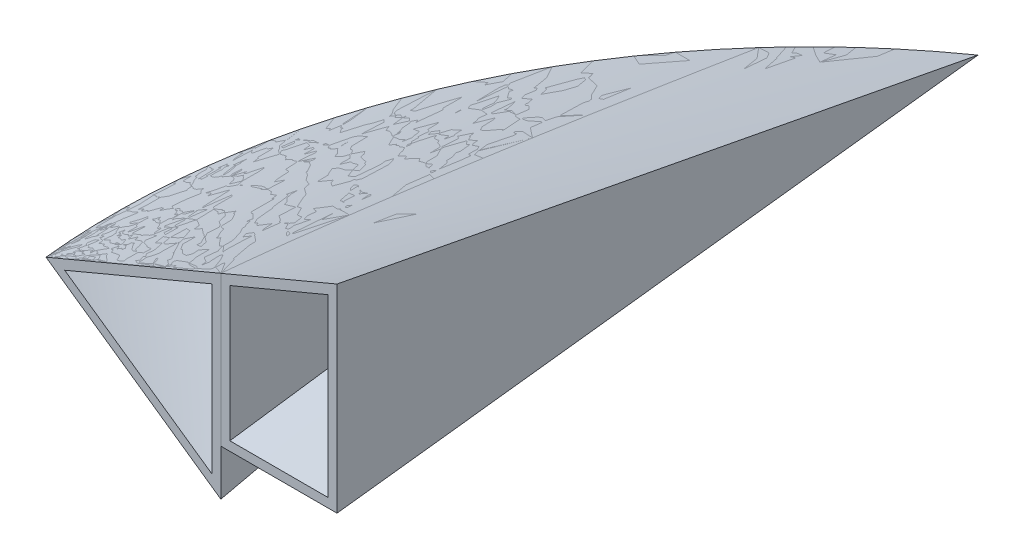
ISO-10303-21;
HEADER;
FILE_DESCRIPTION(('STEP AP214'),'2;1');
FILE_NAME('part.step','',(''),(''),'','','');
FILE_SCHEMA(('AUTOMOTIVE_DESIGN { 1 0 10303 214 1 1 1 1 }'));
ENDSEC;
DATA;
#1=APPLICATION_CONTEXT('core data for automotive mechanical design processes');
#2=APPLICATION_PROTOCOL_DEFINITION('international standard','automotive_design',2000,#1);
#3=PRODUCT_CONTEXT('',#1,'mechanical');
#4=PRODUCT('Part','Part','',(#3));
#5=PRODUCT_RELATED_PRODUCT_CATEGORY('part','',(#4));
#6=PRODUCT_DEFINITION_FORMATION('','',#4);
#7=PRODUCT_DEFINITION_CONTEXT('part definition',#1,'design');
#8=PRODUCT_DEFINITION('design','',#6,#7);
#9=PRODUCT_DEFINITION_SHAPE('','',#8);
#10=(LENGTH_UNIT() NAMED_UNIT(*) SI_UNIT(.MILLI.,.METRE.));
#11=(NAMED_UNIT(*) PLANE_ANGLE_UNIT() SI_UNIT($,.RADIAN.));
#12=(NAMED_UNIT(*) SI_UNIT($,.STERADIAN.) SOLID_ANGLE_UNIT());
#13=UNCERTAINTY_MEASURE_WITH_UNIT(LENGTH_MEASURE(1.E-05),#10,'distance_accuracy_value','');
#14=(GEOMETRIC_REPRESENTATION_CONTEXT(3) GLOBAL_UNCERTAINTY_ASSIGNED_CONTEXT((#13)) GLOBAL_UNIT_ASSIGNED_CONTEXT((#10,
#11,#12)) REPRESENTATION_CONTEXT('',''));
#15=CARTESIAN_POINT('',(0.,0.,0.));
#16=DIRECTION('',(0.,0.,1.));
#17=DIRECTION('',(1.,0.,0.));
#18=AXIS2_PLACEMENT_3D('',#15,#16,#17);
#19=CARTESIAN_POINT('',(-105.774102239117,0.00399017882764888,0.));
#20=DIRECTION('',(0.,0.,-1.));
#21=DIRECTION('',(-1.,0.,0.));
#22=AXIS2_PLACEMENT_3D('',#19,#20,#21);
#23=PLANE('',#22);
#24=DIRECTION('',(0.,1.,0.));
#25=VECTOR('',#24,1.);
#26=CARTESIAN_POINT('',(-2.,0.00399017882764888,0.));
#27=LINE('',#26,#25);
#28=CARTESIAN_POINT('',(-2.,-14.8238925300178,0.));
#29=VERTEX_POINT('',#28);
#30=CARTESIAN_POINT('',(-2.,23.9584061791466,0.));
#31=VERTEX_POINT('',#30);
#32=EDGE_CURVE('E190',#29,#31,#27,.T.);
#33=ORIENTED_EDGE('',*,*,#32,.F.);
#34=CARTESIAN_POINT('',(-2.,-14.8238925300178,0.));
#35=CARTESIAN_POINT('',(-4.92422371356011,-14.8234087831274,0.));
#36=CARTESIAN_POINT('',(-7.84844742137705,-14.8228728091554,0.));
#37=CARTESIAN_POINT('',(-12.9202182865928,-14.8218063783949,0.));
#38=CARTESIAN_POINT('',(-15.06776545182,-14.8213122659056,0.));
#39=CARTESIAN_POINT('',(-19.3628597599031,-14.8202178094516,0.));
#40=CARTESIAN_POINT('',(-21.510406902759,-14.8196174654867,0.));
#41=CARTESIAN_POINT('',(-23.6579540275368,-14.8189534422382,0.));
#42=B_SPLINE_CURVE_WITH_KNOTS('',3,(#34,#35,#36,#37,#38,#39,#40,#41),.UNSPECIFIED.,.F.,.F.,(4,2,
2,4),(0.,8.77267126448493,15.2153129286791,21.6579546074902),.UNSPECIFIED.);
#43=CARTESIAN_POINT('',(-23.6579540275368,-14.8189534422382,0.));
#44=VERTEX_POINT('',#43);
#45=EDGE_CURVE('E196',#29,#44,#42,.T.);
#46=ORIENTED_EDGE('',*,*,#45,.T.);
#47=DIRECTION('',(0.,-1.,0.));
#48=VECTOR('',#47,1.);
#49=CARTESIAN_POINT('',(-23.6579540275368,0.00399017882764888,0.));
#50=LINE('',#49,#48);
#51=CARTESIAN_POINT('',(-23.6579540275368,14.8823136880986,0.));
#52=VERTEX_POINT('',#51);
#53=EDGE_CURVE('E209',#52,#44,#50,.T.);
#54=ORIENTED_EDGE('',*,*,#53,.F.);
#55=CARTESIAN_POINT('',(-2.,23.9584061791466,0.));
#56=CARTESIAN_POINT('',(-3.80507905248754,23.2026607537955,0.));
#57=CARTESIAN_POINT('',(-5.61008491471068,22.4467405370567,0.));
#58=CARTESIAN_POINT('',(-9.21996712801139,20.9345910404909,0.));
#59=CARTESIAN_POINT('',(-11.0248434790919,20.178361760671,0.));
#60=CARTESIAN_POINT('',(-14.6344836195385,18.6656346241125,0.));
#61=CARTESIAN_POINT('',(-16.4392474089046,17.9091367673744,0.));
#62=CARTESIAN_POINT('',(-20.0486737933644,16.3958995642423,0.));
#63=CARTESIAN_POINT('',(-21.8533363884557,15.6391602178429,0.));
#64=CARTESIAN_POINT('',(-23.6579540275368,14.8823136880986,0.));
#65=B_SPLINE_CURVE_WITH_KNOTS('',3,(#55,#56,#57,#58,#59,#60,#61,#62,#63,#64),.UNSPECIFIED.,.F.,
.F.,(4,2,2,2,4),(0.,5.87070298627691,11.7414058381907,17.6121086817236,23.4828116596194),.UNSPECIFIED.);
#66=EDGE_CURVE('E89',#31,#52,#65,.T.);
#67=ORIENTED_EDGE('',*,*,#66,.F.);
#68=EDGE_LOOP('',(#33,#46,#54,#67));
#69=FACE_BOUND('',#68,.T.);
#70=DIRECTION('',(-1.,0.,0.));
#71=VECTOR('',#70,1.);
#72=CARTESIAN_POINT('',(-12.8289770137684,-16.8383069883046,0.));
#73=LINE('',#72,#71);
#74=CARTESIAN_POINT('',(0.,-16.8383069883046,0.));
#75=VERTEX_POINT('',#74);
#76=CARTESIAN_POINT('',(-25.6579540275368,-16.8383069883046,0.));
#77=VERTEX_POINT('',#76);
#78=EDGE_CURVE('E125',#75,#77,#73,.T.);
#79=ORIENTED_EDGE('',*,*,#78,.F.);
#80=DIRECTION('',(0.,1.,0.));
#81=VECTOR('',#80,1.);
#82=CARTESIAN_POINT('',(0.,5.07939105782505,0.));
#83=LINE('',#82,#81);
#84=CARTESIAN_POINT('',(0.,26.9970891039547,0.));
#85=VERTEX_POINT('',#84);
#86=EDGE_CURVE('E147',#75,#85,#83,.T.);
#87=ORIENTED_EDGE('',*,*,#86,.T.);
#88=DIRECTION('',(-0.921972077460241,-0.387256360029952,0.));
#89=VECTOR('',#88,1.);
#90=CARTESIAN_POINT('',(-32.137060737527,13.4985445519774,0.));
#91=LINE('',#90,#89);
#92=CARTESIAN_POINT('',(-25.6579540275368,16.2199667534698,0.));
#93=VERTEX_POINT('',#92);
#94=EDGE_CURVE('E98',#85,#93,#91,.T.);
#95=ORIENTED_EDGE('',*,*,#94,.T.);
#96=DIRECTION('',(0.,-1.,0.));
#97=VECTOR('',#96,1.);
#98=CARTESIAN_POINT('',(-25.6579540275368,-0.309170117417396,0.));
#99=LINE('',#98,#97);
#100=EDGE_CURVE('E129',#93,#77,#99,.T.);
#101=ORIENTED_EDGE('',*,*,#100,.T.);
#102=EDGE_LOOP('',(#79,#87,#95,#101));
#103=FACE_BOUND('',#102,.T.);
#104=ADVANCED_FACE('F67',(#69,#103),#23,.F.);
#105=CARTESIAN_POINT('',(-25.6579540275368,-16.8383069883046,0.));
#106=DIRECTION('',(1.,0.,0.));
#107=DIRECTION('',(0.,0.140348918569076,-0.990102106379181));
#108=AXIS2_PLACEMENT_3D('',#105,#106,#107);
#109=PLANE('',#108);
#110=DIRECTION('',(0.,0.140348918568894,-0.990102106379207));
#111=VECTOR('',#110,1.);
#112=CARTESIAN_POINT('',(-25.6579540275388,-8.41915349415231,-59.3935578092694));
#113=LINE('',#112,#111);
#114=CARTESIAN_POINT('',(-25.6579540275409,0.,-118.787115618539));
#115=VERTEX_POINT('',#114);
#116=EDGE_CURVE('E120',#77,#115,#113,.T.);
#117=ORIENTED_EDGE('',*,*,#116,.F.);
#118=ORIENTED_EDGE('',*,*,#100,.F.);
#119=CARTESIAN_POINT('',(-25.6579540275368,16.2199667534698,0.));
#120=CARTESIAN_POINT('',(-25.6579540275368,16.1289346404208,-0.997116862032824));
#121=CARTESIAN_POINT('',(-25.6579540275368,16.035851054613,-1.9940446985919));
#122=CARTESIAN_POINT('',(-25.6579540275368,15.8458203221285,-3.98753006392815));
#123=CARTESIAN_POINT('',(-25.6579540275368,15.7488731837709,-4.98408759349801));
#124=CARTESIAN_POINT('',(-25.6579540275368,15.45260218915,-7.97314936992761));
#125=CARTESIAN_POINT('',(-25.6579540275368,15.2478420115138,-9.96511626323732));
#126=CARTESIAN_POINT('',(-25.6579540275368,14.8254741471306,-13.9476648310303));
#127=CARTESIAN_POINT('',(-25.6579540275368,14.6078665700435,-15.9382465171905));
#128=CARTESIAN_POINT('',(-25.6579540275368,14.1612298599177,-19.9178538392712));
#129=CARTESIAN_POINT('',(-25.6579540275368,13.9322022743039,-21.9068796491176));
#130=CARTESIAN_POINT('',(-25.6579540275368,13.463898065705,-25.8837398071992));
#131=CARTESIAN_POINT('',(-25.6579540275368,13.2246213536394,-27.8715741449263));
#132=CARTESIAN_POINT('',(-25.6579540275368,12.7368577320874,-31.846116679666));
#133=CARTESIAN_POINT('',(-25.6579540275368,12.4883707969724,-33.8328248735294));
#134=CARTESIAN_POINT('',(-25.6579540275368,11.9831238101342,-37.8049101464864));
#135=CARTESIAN_POINT('',(-25.6579540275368,11.7263649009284,-39.7902873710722));
#136=CARTESIAN_POINT('',(-25.6579540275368,11.2053295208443,-43.7600467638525));
#137=CARTESIAN_POINT('',(-25.6579540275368,10.941053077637,-45.7444289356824));
#138=CARTESIAN_POINT('',(-25.6579540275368,10.4056724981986,-49.7122696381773));
#139=CARTESIAN_POINT('',(-25.6579540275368,10.1345683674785,-51.6957281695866));
#140=CARTESIAN_POINT('',(-25.6579540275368,9.58612224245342,-55.6619177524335));
#141=CARTESIAN_POINT('',(-25.6579540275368,9.30877983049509,-57.6446487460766));
#142=CARTESIAN_POINT('',(-25.6579540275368,8.74841314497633,-61.6093082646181));
#143=CARTESIAN_POINT('',(-25.6579540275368,8.46538886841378,-63.591236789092));
#144=CARTESIAN_POINT('',(-25.6579540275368,7.8941361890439,-67.5543435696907));
#145=CARTESIAN_POINT('',(-25.6579540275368,7.60590778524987,-69.5355218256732));
#146=CARTESIAN_POINT('',(-25.6579540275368,6.92950918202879,-74.1458222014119));
#147=CARTESIAN_POINT('',(-25.6579540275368,6.53951890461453,-76.7746773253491));
#148=CARTESIAN_POINT('',(-25.6579540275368,5.7519996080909,-82.031258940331));
#149=CARTESIAN_POINT('',(-25.6579540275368,5.35447058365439,-84.6589854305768));
#150=CARTESIAN_POINT('',(-25.6579540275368,4.55263073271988,-89.9134075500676));
#151=CARTESIAN_POINT('',(-25.6579540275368,4.14831989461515,-92.5401031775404));
#152=CARTESIAN_POINT('',(-25.6579540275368,3.33363326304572,-97.79217815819));
#153=CARTESIAN_POINT('',(-25.6579540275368,2.92325832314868,-100.417557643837));
#154=CARTESIAN_POINT('',(-25.6579540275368,2.09696980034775,-105.667438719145));
#155=CARTESIAN_POINT('',(-25.6579540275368,1.68105622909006,-108.291940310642));
#156=CARTESIAN_POINT('',(-25.6579540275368,0.844186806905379,-113.540122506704));
#157=CARTESIAN_POINT('',(-25.6579540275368,0.423230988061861,-116.163803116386));
#158=CARTESIAN_POINT('',(-25.6579540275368,7.25665359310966E-13,-118.787115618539));
#159=B_SPLINE_CURVE_WITH_KNOTS('',3,(#119,#120,#121,#122,#123,#124,#125,#126,#127,#128,#129,
#130,#131,#132,#133,#134,#135,#136,#137,#138,#139,#140,#141,#142,#143,#144,#145,#146,#147,#148,
#149,#150,#151,#152,#153,#154,#155,#156,#157,#158),.UNSPECIFIED.,.F.,.F.,(4,2,2,2,2,2,2,2,2,2,2,
2,2,2,2,2,2,2,2,4),(0.,3.00378590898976,6.00756535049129,12.0149029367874,18.0221892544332,
24.0286637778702,30.0351905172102,36.041733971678,42.0474513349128,48.0531465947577,
54.0588370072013,60.0649307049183,66.0710275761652,72.0771255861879,80.049988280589,
88.0228566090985,95.9957385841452,103.967508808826,111.939262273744,119.91096504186),.UNSPECIFIED.);
#160=EDGE_CURVE('E71',#93,#115,#159,.T.);
#161=ORIENTED_EDGE('',*,*,#160,.T.);
#162=EDGE_LOOP('',(#117,#118,#161));
#163=FACE_BOUND('',#162,.T.);
#164=ADVANCED_FACE('F133',(#163),#109,.F.);
#165=CARTESIAN_POINT('',(0.,-16.8383069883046,0.));
#166=CARTESIAN_POINT('',(0.,0.,-141.580597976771));
#167=CARTESIAN_POINT('',(-4.27632567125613,-16.8383069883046,0.));
#168=CARTESIAN_POINT('',(-4.74564252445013,0.,-138.231215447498));
#169=CARTESIAN_POINT('',(-8.55265134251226,-16.8383069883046,0.));
#170=CARTESIAN_POINT('',(-9.26382331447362,0.,-134.641214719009));
#171=CARTESIAN_POINT('',(-17.1053026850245,-16.8383069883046,0.));
#172=CARTESIAN_POINT('',(-17.8236713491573,0.,-127.027534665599));
#173=CARTESIAN_POINT('',(-21.3816283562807,-16.8383069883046,0.));
#174=CARTESIAN_POINT('',(-21.8653385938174,0.,-123.003855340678));
#175=CARTESIAN_POINT('',(-25.6579540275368,-16.8383069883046,0.));
#176=CARTESIAN_POINT('',(-25.6579540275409,0.,-118.787115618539));
#177=B_SPLINE_SURFACE_WITH_KNOTS('',3,1,((#165,#166),(#167,#168),(#169,#170),(#171,#172),(#173,
#174),(#175,#176)),.UNSPECIFIED.,.F.,.F.,.F.,(4,2,4),(2,2),(0.,0.5,1.),(0.,1.),.UNSPECIFIED.);
#178=CARTESIAN_POINT('',(0.,0.,-141.580597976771));
#179=CARTESIAN_POINT('',(-4.74564252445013,0.,-138.231215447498));
#180=CARTESIAN_POINT('',(-9.26382331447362,0.,-134.641214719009));
#181=CARTESIAN_POINT('',(-17.8236713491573,0.,-127.027534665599));
#182=CARTESIAN_POINT('',(-21.8653385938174,0.,-123.003855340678));
#183=CARTESIAN_POINT('',(-25.6579540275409,0.,-118.787115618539));
#184=B_SPLINE_CURVE_WITH_KNOTS('',3,(#178,#179,#180,#181,#182,#183),.UNSPECIFIED.,.F.,.F.,(4,2,
4),(0.,0.5,1.),.UNSPECIFIED.);
#185=CARTESIAN_POINT('',(0.,0.,-141.580597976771));
#186=VERTEX_POINT('',#185);
#187=EDGE_CURVE('E81',#115,#186,#184,.F.);
#188=DIRECTION('',(0.,-0.118098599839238,0.993001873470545));
#189=VECTOR('',#188,1.);
#190=CARTESIAN_POINT('',(0.,-8.4191534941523,-70.7902989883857));
#191=LINE('',#190,#189);
#192=EDGE_CURVE('E140',#186,#75,#191,.T.);
#193=ORIENTED_EDGE('',*,*,#78,.T.);
#194=ORIENTED_EDGE('',*,*,#116,.T.);
#195=ORIENTED_EDGE('',*,*,#187,.T.);
#196=ORIENTED_EDGE('',*,*,#192,.T.);
#197=EDGE_LOOP('',(#193,#194,#195,#196));
#198=FACE_BOUND('',#197,.T.);
#199=ADVANCED_FACE('F122',(#198),#177,.T.);
#200=CARTESIAN_POINT('',(0.,26.9970891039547,0.));
#201=DIRECTION('',(-1.,0.,0.));
#202=DIRECTION('',(0.,-0.187308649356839,-0.982301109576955));
#203=AXIS2_PLACEMENT_3D('',#200,#201,#202);
#204=PLANE('',#203);
#205=DIRECTION('',(0.,0.187308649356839,0.982301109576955));
#206=VECTOR('',#205,1.);
#207=CARTESIAN_POINT('',(0.,13.4985445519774,-70.7902989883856));
#208=LINE('',#207,#206);
#209=EDGE_CURVE('E14',#186,#85,#208,.T.);
#210=ORIENTED_EDGE('',*,*,#209,.T.);
#211=ORIENTED_EDGE('',*,*,#86,.F.);
#212=ORIENTED_EDGE('',*,*,#192,.F.);
#213=EDGE_LOOP('',(#210,#211,#212));
#214=FACE_BOUND('',#213,.T.);
#215=ADVANCED_FACE('F69',(#214),#204,.F.);
#216=CARTESIAN_POINT('',(0.,26.9970891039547,0.));
#217=CARTESIAN_POINT('',(0.,17.9980594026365,-47.1935326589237));
#218=CARTESIAN_POINT('',(0.,8.99902970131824,-94.3870653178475));
#219=CARTESIAN_POINT('',(0.,0.,-141.580597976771));
#220=CARTESIAN_POINT('',(-21.4247071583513,17.9980594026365,0.));
#221=CARTESIAN_POINT('',(-29.4354540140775,11.9987062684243,-36.4993217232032));
#222=CARTESIAN_POINT('',(-37.4462008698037,5.99935313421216,-72.9986434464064));
#223=CARTESIAN_POINT('',(-45.4569477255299,0.,-109.49796516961));
#224=CARTESIAN_POINT('',(-42.8494143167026,8.99902970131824,0.));
#225=CARTESIAN_POINT('',(-51.9142990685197,5.99935313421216,-18.4461291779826));
#226=CARTESIAN_POINT('',(-60.9791838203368,2.99967656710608,-36.8922583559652));
#227=CARTESIAN_POINT('',(-70.0440685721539,0.,-55.3383875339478));
#228=CARTESIAN_POINT('',(-64.274121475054,0.,0.));
#229=CARTESIAN_POINT('',(-64.274121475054,0.,0.));
#230=CARTESIAN_POINT('',(-64.274121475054,0.,0.));
#231=CARTESIAN_POINT('',(-64.274121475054,0.,0.));
#232=B_SPLINE_SURFACE_WITH_KNOTS('',3,3,((#216,#217,#218,#219),(#220,#221,#222,#223),(#224,#225,
#226,#227),(#228,#229,#230,#231)),.UNSPECIFIED.,.F.,.F.,.F.,(4,4),(4,4),(0.,1.),(0.,1.),.UNSPECIFIED.);
#233=ORIENTED_EDGE('',*,*,#94,.F.);
#234=ORIENTED_EDGE('',*,*,#209,.F.);
#235=ORIENTED_EDGE('',*,*,#187,.F.);
#236=ORIENTED_EDGE('',*,*,#160,.F.);
#237=EDGE_LOOP('',(#233,#234,#235,#236));
#238=FACE_BOUND('',#237,.T.);
#239=ADVANCED_FACE('F131',(#238),#232,.F.);
#240=CARTESIAN_POINT('',(-23.6579540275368,-16.8383069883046,0.));
#241=DIRECTION('',(1.,0.,0.));
#242=DIRECTION('',(0.,0.140348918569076,-0.990102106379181));
#243=AXIS2_PLACEMENT_3D('',#240,#241,#242);
#244=PLANE('',#243);
#245=CARTESIAN_POINT('',(-23.6579540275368,-14.8189534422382,0.));
#246=CARTESIAN_POINT('',(-23.6579540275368,-13.2034172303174,-11.5847915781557));
#247=CARTESIAN_POINT('',(-23.6579540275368,-11.5881565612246,-23.1696215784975));
#248=CARTESIAN_POINT('',(-23.6579540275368,-8.2857675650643,-46.8584699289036));
#249=CARTESIAN_POINT('',(-23.6579540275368,-6.59866219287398,-58.9624914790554));
#250=CARTESIAN_POINT('',(-23.6579540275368,-3.22494132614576,-83.170602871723));
#251=CARTESIAN_POINT('',(-23.6579540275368,-1.53832583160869,-95.2746927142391));
#252=CARTESIAN_POINT('',(-23.6579540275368,0.148073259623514,-107.378812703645));
#253=B_SPLINE_CURVE_WITH_KNOTS('',3,(#245,#246,#247,#248,#249,#250,#251,#252),.UNSPECIFIED.,.F.,
.F.,(4,2,2,4),(0.,35.0906850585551,71.7537858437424,108.416886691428),.UNSPECIFIED.);
#254=CARTESIAN_POINT('',(-23.6579540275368,0.148073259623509,-107.378812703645));
#255=VERTEX_POINT('',#254);
#256=EDGE_CURVE('E214',#44,#255,#253,.T.);
#257=ORIENTED_EDGE('',*,*,#256,.T.);
#258=CARTESIAN_POINT('',(-23.6579540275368,14.8823136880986,0.));
#259=CARTESIAN_POINT('',(-23.6579540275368,14.7858292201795,-1.00551709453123));
#260=CARTESIAN_POINT('',(-23.6579540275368,14.6873193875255,-2.01083815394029));
#261=CARTESIAN_POINT('',(-23.6579540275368,14.4864902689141,-4.0210977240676));
#262=CARTESIAN_POINT('',(-23.6579540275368,14.3841709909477,-5.02603623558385));
#263=CARTESIAN_POINT('',(-23.6579540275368,14.071867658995,-8.04022734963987));
#264=CARTESIAN_POINT('',(-23.6579540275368,13.8565312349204,-10.0489267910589));
#265=CARTESIAN_POINT('',(-23.6579540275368,13.4132434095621,-14.0649112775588));
#266=CARTESIAN_POINT('',(-23.6579540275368,13.185292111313,-16.0721963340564));
#267=CARTESIAN_POINT('',(-23.6579540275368,12.7182019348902,-20.0852154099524));
#268=CARTESIAN_POINT('',(-23.6579540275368,12.4790644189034,-22.0909495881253));
#269=CARTESIAN_POINT('',(-23.6579540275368,11.99077546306,-26.1012136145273));
#270=CARTESIAN_POINT('',(-23.6579540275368,11.7416239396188,-28.1057434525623));
#271=CARTESIAN_POINT('',(-23.6579540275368,11.2343429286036,-32.1136707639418));
#272=CARTESIAN_POINT('',(-23.6579540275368,10.9762134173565,-34.1170682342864));
#273=CARTESIAN_POINT('',(-23.6579540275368,10.4543541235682,-38.1038563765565));
#274=CARTESIAN_POINT('',(-23.6579540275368,10.1907004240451,-40.0872570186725));
#275=CARTESIAN_POINT('',(-23.6579540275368,9.65622539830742,-44.0530842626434));
#276=CARTESIAN_POINT('',(-23.6579540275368,9.38540409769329,-46.0355108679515));
#277=CARTESIAN_POINT('',(-23.6579540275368,8.83725916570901,-49.9994626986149));
#278=CARTESIAN_POINT('',(-23.6579540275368,8.55993553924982,-51.9809879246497));
#279=CARTESIAN_POINT('',(-23.6579540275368,7.99935692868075,-55.9433067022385));
#280=CARTESIAN_POINT('',(-23.6579540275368,7.71610162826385,-57.9241002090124));
#281=CARTESIAN_POINT('',(-23.6579540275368,7.14419196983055,-61.8849082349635));
#282=CARTESIAN_POINT('',(-23.6579540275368,6.85553760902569,-63.8649227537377));
#283=CARTESIAN_POINT('',(-23.6579540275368,6.27328950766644,-67.8242252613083));
#284=CARTESIAN_POINT('',(-23.6579540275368,5.97969576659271,-69.8035132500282));
#285=CARTESIAN_POINT('',(-23.6579540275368,5.38790320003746,-73.7619121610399));
#286=CARTESIAN_POINT('',(-23.6579540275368,5.08970322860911,-75.7410229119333));
#287=CARTESIAN_POINT('',(-23.6579540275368,4.48913641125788,-79.6986113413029));
#288=CARTESIAN_POINT('',(-23.6579540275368,4.18676956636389,-81.6770890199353));
#289=CARTESIAN_POINT('',(-23.6579540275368,3.57819640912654,-85.6334545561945));
#290=CARTESIAN_POINT('',(-23.6579540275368,3.27199009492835,-87.611342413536));
#291=CARTESIAN_POINT('',(-23.6579540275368,2.65606042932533,-91.5663837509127));
#292=CARTESIAN_POINT('',(-23.6579540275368,2.34633740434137,-93.5435372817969));
#293=CARTESIAN_POINT('',(-23.6579540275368,1.72361313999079,-97.4973265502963));
#294=CARTESIAN_POINT('',(-23.6579540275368,1.41061190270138,-99.4739622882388));
#295=CARTESIAN_POINT('',(-23.6579540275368,0.781566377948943,-103.426744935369));
#296=CARTESIAN_POINT('',(-23.6579540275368,0.465522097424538,-105.402891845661));
#297=CARTESIAN_POINT('',(-23.6579540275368,0.148073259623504,-107.378812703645));
#298=B_SPLINE_CURVE_WITH_KNOTS('',3,(#258,#259,#260,#261,#262,#263,#264,#265,#266,#267,#268,
#269,#270,#271,#272,#273,#274,#275,#276,#277,#278,#279,#280,#281,#282,#283,#284,#285,#286,#287,
#288,#289,#290,#291,#292,#293,#294,#295,#296,#297),.UNSPECIFIED.,.F.,.F.,(4,2,2,2,2,2,2,2,2,2,2,
2,2,2,2,2,2,2,2,4),(0.,3.03040185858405,6.06079736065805,12.1213736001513,18.1819003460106,
24.2416909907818,30.3015322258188,36.3613894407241,42.3639180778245,48.3664252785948,
54.3689279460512,60.371751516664,66.3745781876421,72.3774054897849,78.3817510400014,
84.3860951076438,90.3904420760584,96.3942362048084,102.398026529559,108.401803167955),.UNSPECIFIED.);
#299=EDGE_CURVE('E204',#52,#255,#298,.T.);
#300=ORIENTED_EDGE('',*,*,#299,.F.);
#301=ORIENTED_EDGE('',*,*,#53,.T.);
#302=EDGE_LOOP('',(#257,#300,#301));
#303=FACE_BOUND('',#302,.T.);
#304=ADVANCED_FACE('F294',(#303),#244,.T.);
#305=CARTESIAN_POINT('',(0.,-16.8383069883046,0.));
#306=CARTESIAN_POINT('',(0.,0.,-141.580597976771));
#307=CARTESIAN_POINT('',(-4.27632567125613,-16.8383069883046,0.));
#308=CARTESIAN_POINT('',(-4.74564252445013,0.,-138.231215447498));
#309=CARTESIAN_POINT('',(-8.55265134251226,-16.8383069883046,0.));
#310=CARTESIAN_POINT('',(-9.26382331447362,0.,-134.641214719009));
#311=CARTESIAN_POINT('',(-17.1053026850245,-16.8383069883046,0.));
#312=CARTESIAN_POINT('',(-17.8236713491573,0.,-127.027534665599));
#313=CARTESIAN_POINT('',(-21.3816283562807,-16.8383069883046,0.));
#314=CARTESIAN_POINT('',(-21.8653385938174,0.,-123.003855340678));
#315=CARTESIAN_POINT('',(-25.6579540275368,-16.8383069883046,0.));
#316=CARTESIAN_POINT('',(-25.6579540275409,0.,-118.787115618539));
#317=B_SPLINE_SURFACE_WITH_KNOTS('',3,1,((#305,#306),(#307,#308),(#309,#310),(#311,#312),(#313,
#314),(#315,#316)),.UNSPECIFIED.,.F.,.F.,.F.,(4,2,4),(2,2),(0.,0.5,1.),(0.,1.),.UNSPECIFIED.);
#318=OFFSET_SURFACE('',#317,-2.,.F.);
#319=ORIENTED_EDGE('',*,*,#45,.F.);
#320=CARTESIAN_POINT('',(-1.99999999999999,0.43487005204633,-126.933999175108));
#321=CARTESIAN_POINT('',(-1.99999999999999,-2.35569968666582,-103.707244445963));
#322=CARTESIAN_POINT('',(-1.99999999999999,-5.14709372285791,-80.4805888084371));
#323=CARTESIAN_POINT('',(-2.,-10.233615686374,-38.1692879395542));
#324=CARTESIAN_POINT('',(-2.,-12.5284758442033,-19.0846105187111));
#325=CARTESIAN_POINT('',(-2.,-14.8238925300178,0.));
#326=B_SPLINE_CURVE_WITH_KNOTS('',3,(#320,#321,#322,#323,#324,#325),.UNSPECIFIED.,.F.,.F.,(4,2,
4),(0.,70.1813701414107,127.847839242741),.UNSPECIFIED.);
#327=CARTESIAN_POINT('',(-1.99999999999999,0.43487005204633,-126.933999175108));
#328=VERTEX_POINT('',#327);
#329=EDGE_CURVE('E195',#328,#29,#326,.T.);
#330=ORIENTED_EDGE('',*,*,#329,.F.);
#331=CARTESIAN_POINT('',(-23.6579540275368,0.148073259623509,-107.378812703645));
#332=CARTESIAN_POINT('',(-22.6636558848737,0.166120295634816,-108.451557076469));
#333=CARTESIAN_POINT('',(-21.6552899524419,0.183492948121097,-109.511285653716));
#334=CARTESIAN_POINT('',(-19.6108817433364,0.217006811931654,-111.603726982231));
#335=CARTESIAN_POINT('',(-18.5748393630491,0.233148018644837,-112.63643963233));
#336=CARTESIAN_POINT('',(-16.4755333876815,0.264316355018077,-114.673868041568));
#337=CARTESIAN_POINT('',(-15.4122694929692,0.279343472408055,-115.678583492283));
#338=CARTESIAN_POINT('',(-13.2590950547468,0.30838185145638,-117.659054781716));
#339=CARTESIAN_POINT('',(-12.1691843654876,0.322393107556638,-118.63481046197));
#340=CARTESIAN_POINT('',(-9.60022642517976,0.353949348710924,-120.87274676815));
#341=CARTESIAN_POINT('',(-8.11118086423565,0.371139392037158,-122.123485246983));
#342=CARTESIAN_POINT('',(-5.08854032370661,0.404058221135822,-124.570300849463));
#343=CARTESIAN_POINT('',(-3.55494020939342,0.419786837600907,-125.766371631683));
#344=CARTESIAN_POINT('',(-1.99999999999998,0.434870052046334,-126.933999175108));
#345=B_SPLINE_CURVE_WITH_KNOTS('',3,(#331,#332,#333,#334,#335,#336,#337,#338,#339,#340,#341,
#342,#343,#344),.UNSPECIFIED.,.F.,.F.,(4,2,2,2,2,2,4),(0.,4.38823642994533,8.77648929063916,
13.1647904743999,17.5531156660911,23.385929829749,29.2194188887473),.UNSPECIFIED.);
#346=EDGE_CURVE('E225',#255,#328,#345,.T.);
#347=ORIENTED_EDGE('',*,*,#346,.F.);
#348=ORIENTED_EDGE('',*,*,#256,.F.);
#349=EDGE_LOOP('',(#319,#330,#347,#348));
#350=FACE_BOUND('',#349,.T.);
#351=ADVANCED_FACE('F284',(#350),#318,.F.);
#352=CARTESIAN_POINT('',(-2.,26.9970891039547,0.));
#353=DIRECTION('',(-1.,0.,0.));
#354=DIRECTION('',(0.,-0.187308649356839,-0.982301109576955));
#355=AXIS2_PLACEMENT_3D('',#352,#353,#354);
#356=PLANE('',#355);
#357=CARTESIAN_POINT('',(-1.99999999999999,0.43487005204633,-126.933999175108));
#358=CARTESIAN_POINT('',(-1.99999999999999,1.55570101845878,-120.979755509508));
#359=CARTESIAN_POINT('',(-1.99999999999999,2.67551282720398,-115.025319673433));
#360=CARTESIAN_POINT('',(-1.99999999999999,4.91233810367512,-103.115915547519));
#361=CARTESIAN_POINT('',(-1.99999999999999,6.02935156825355,-97.1609472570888));
#362=CARTESIAN_POINT('',(-1.99999999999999,8.2598176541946,-85.2503432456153));
#363=CARTESIAN_POINT('',(-1.99999999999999,9.37327027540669,-79.2947075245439));
#364=CARTESIAN_POINT('',(-1.99999999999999,11.0398873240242,-70.3605919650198));
#365=CARTESIAN_POINT('',(-1.99999999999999,11.5948324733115,-67.3824442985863));
#366=CARTESIAN_POINT('',(-1.99999999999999,12.7033374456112,-61.4258906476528));
#367=CARTESIAN_POINT('',(-2.,13.2568972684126,-58.4474846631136));
#368=CARTESIAN_POINT('',(-2.,14.3812543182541,-52.3887566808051));
#369=CARTESIAN_POINT('',(-2.,14.9519953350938,-49.3084242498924));
#370=CARTESIAN_POINT('',(-2.,16.0914212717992,-43.1473793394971));
#371=CARTESIAN_POINT('',(-2.,16.6601061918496,-40.0666668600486));
#372=CARTESIAN_POINT('',(-2.,17.7950135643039,-33.9047894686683));
#373=CARTESIAN_POINT('',(-2.,18.3612360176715,-30.823624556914));
#374=CARTESIAN_POINT('',(-2.,19.4907031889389,-24.6607384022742));
#375=CARTESIAN_POINT('',(-2.,20.0539478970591,-21.5790171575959));
#376=CARTESIAN_POINT('',(-2.,21.1767934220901,-15.4149093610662));
#377=CARTESIAN_POINT('',(-2.,21.7363942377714,-12.3325228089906));
#378=CARTESIAN_POINT('',(-2.,22.5724044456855,-7.7083271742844));
#379=CARTESIAN_POINT('',(-2.,22.8505095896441,-6.16682463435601));
#380=CARTESIAN_POINT('',(-2.,23.4054475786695,-3.08359033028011));
#381=CARTESIAN_POINT('',(-2.,23.6822804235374,-1.5418585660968));
#382=CARTESIAN_POINT('',(-2.,23.9584061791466,0.));
#383=B_SPLINE_CURVE_WITH_KNOTS('',3,(#357,#358,#359,#360,#361,#362,#363,#364,#365,#366,#367,
#368,#369,#370,#371,#372,#373,#374,#375,#376,#377,#378,#379,#380,#381,#382),.UNSPECIFIED.,.F.,
.F.,(4,2,2,2,2,2,2,2,2,2,2,2,4),(0.,18.176455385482,36.3529312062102,54.5294077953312,
63.6176388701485,72.7058713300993,82.1041545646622,91.5024369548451,100.900715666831,
110.299025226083,119.697337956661,124.396502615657,129.095668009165),.UNSPECIFIED.);
#384=EDGE_CURVE('E184',#328,#31,#383,.T.);
#385=ORIENTED_EDGE('',*,*,#384,.F.);
#386=ORIENTED_EDGE('',*,*,#329,.T.);
#387=ORIENTED_EDGE('',*,*,#32,.T.);
#388=EDGE_LOOP('',(#385,#386,#387));
#389=FACE_BOUND('',#388,.T.);
#390=ADVANCED_FACE('F278',(#389),#356,.T.);
#391=CARTESIAN_POINT('',(0.,26.9970891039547,0.));
#392=CARTESIAN_POINT('',(0.,17.9980594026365,-47.1935326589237));
#393=CARTESIAN_POINT('',(0.,8.99902970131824,-94.3870653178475));
#394=CARTESIAN_POINT('',(0.,0.,-141.580597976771));
#395=CARTESIAN_POINT('',(-21.4247071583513,17.9980594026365,0.));
#396=CARTESIAN_POINT('',(-29.4354540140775,11.9987062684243,-36.4993217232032));
#397=CARTESIAN_POINT('',(-37.4462008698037,5.99935313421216,-72.9986434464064));
#398=CARTESIAN_POINT('',(-45.4569477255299,0.,-109.49796516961));
#399=CARTESIAN_POINT('',(-42.8494143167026,8.99902970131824,0.));
#400=CARTESIAN_POINT('',(-51.9142990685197,5.99935313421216,-18.4461291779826));
#401=CARTESIAN_POINT('',(-60.9791838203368,2.99967656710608,-36.8922583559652));
#402=CARTESIAN_POINT('',(-70.0440685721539,0.,-55.3383875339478));
#403=CARTESIAN_POINT('',(-64.274121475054,0.,0.));
#404=CARTESIAN_POINT('',(-64.274121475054,0.,0.));
#405=CARTESIAN_POINT('',(-64.274121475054,0.,0.));
#406=CARTESIAN_POINT('',(-64.274121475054,0.,0.));
#407=B_SPLINE_SURFACE_WITH_KNOTS('',3,3,((#391,#392,#393,#394),(#395,#396,#397,#398),(#399,#400,
#401,#402),(#403,#404,#405,#406)),.UNSPECIFIED.,.F.,.F.,.F.,(4,4),(4,4),(0.,1.),(0.,1.),.UNSPECIFIED.);
#408=OFFSET_SURFACE('',#407,2.,.F.);
#409=ORIENTED_EDGE('',*,*,#66,.T.);
#410=ORIENTED_EDGE('',*,*,#299,.T.);
#411=ORIENTED_EDGE('',*,*,#346,.T.);
#412=ORIENTED_EDGE('',*,*,#384,.T.);
#413=EDGE_LOOP('',(#409,#410,#411,#412));
#414=FACE_BOUND('',#413,.T.);
#415=ADVANCED_FACE('F281',(#414),#408,.T.);
#416=CLOSED_SHELL('',(#104,#164,#199,#215,#239,#304,#351,#390,#415));
#417=MANIFOLD_SOLID_BREP('B2',#416);
#418=CARTESIAN_POINT('',(-64.274121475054,0.,0.));
#419=DIRECTION('',(0.,0.,-1.));
#420=DIRECTION('',(-1.,0.,0.));
#421=AXIS2_PLACEMENT_3D('',#418,#419,#420);
#422=PLANE('',#421);
#423=DIRECTION('',(0.819652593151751,-0.572860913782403,0.));
#424=VECTOR('',#423,1.);
#425=CARTESIAN_POINT('',(-44.9660377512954,-13.4945543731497,0.));
#426=LINE('',#425,#424);
#427=CARTESIAN_POINT('',(-64.274121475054,0.,0.));
#428=VERTEX_POINT('',#427);
#429=CARTESIAN_POINT('',(-25.6579540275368,-26.9891087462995,0.));
#430=VERTEX_POINT('',#429);
#431=EDGE_CURVE('E594',#428,#430,#426,.T.);
#432=ORIENTED_EDGE('',*,*,#431,.T.);
#433=DIRECTION('',(0.,1.,0.));
#434=VECTOR('',#433,1.);
#435=CARTESIAN_POINT('',(-25.6579540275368,-26.9891087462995,0.));
#436=LINE('',#435,#434);
#437=CARTESIAN_POINT('',(-25.6579540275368,16.2199667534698,0.));
#438=VERTEX_POINT('',#437);
#439=EDGE_CURVE('E524',#430,#438,#436,.T.);
#440=ORIENTED_EDGE('',*,*,#439,.T.);
#441=DIRECTION('',(-0.921972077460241,-0.387256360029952,0.));
#442=VECTOR('',#441,1.);
#443=CARTESIAN_POINT('',(-32.137060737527,13.4985445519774,0.));
#444=LINE('',#443,#442);
#445=EDGE_CURVE('E472',#438,#428,#444,.T.);
#446=ORIENTED_EDGE('',*,*,#445,.T.);
#447=EDGE_LOOP('',(#432,#440,#446));
#448=FACE_BOUND('',#447,.T.);
#449=CARTESIAN_POINT('',(-60.1519355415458,-0.438763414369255,0.));
#450=CARTESIAN_POINT('',(-56.8943545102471,-2.71748383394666,0.));
#451=CARTESIAN_POINT('',(-53.6361752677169,-4.99534963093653,0.));
#452=CARTESIAN_POINT('',(-47.118414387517,-9.54907400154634,0.));
#453=CARTESIAN_POINT('',(-43.8588327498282,-11.824932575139,0.));
#454=CARTESIAN_POINT('',(-36.2864352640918,-17.108042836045,0.));
#455=CARTESIAN_POINT('',(-31.9730170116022,-20.1144310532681,0.));
#456=CARTESIAN_POINT('',(-27.6579540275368,-23.1184584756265,0.));
#457=B_SPLINE_CURVE_WITH_KNOTS('',3,(#449,#450,#451,#452,#453,#454,#455,#456),.UNSPECIFIED.,.F.,
.F.,(4,2,2,4),(0.,11.9264251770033,23.8528505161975,39.6261022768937),.UNSPECIFIED.);
#458=CARTESIAN_POINT('',(-60.1519355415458,-0.438763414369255,0.));
#459=VERTEX_POINT('',#458);
#460=CARTESIAN_POINT('',(-27.6579540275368,-23.1184584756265,0.));
#461=VERTEX_POINT('',#460);
#462=EDGE_CURVE('E514',#459,#461,#457,.T.);
#463=ORIENTED_EDGE('',*,*,#462,.F.);
#464=CARTESIAN_POINT('',(-27.6579540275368,13.2045265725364,0.));
#465=CARTESIAN_POINT('',(-33.0743235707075,10.9323262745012,0.));
#466=CARTESIAN_POINT('',(-38.490340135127,8.65928529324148,0.));
#467=CARTESIAN_POINT('',(-49.3216673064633,4.11152196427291,0.));
#468=CARTESIAN_POINT('',(-54.7369779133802,1.83679961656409,0.));
#469=CARTESIAN_POINT('',(-60.1519355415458,-0.43876341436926,0.));
#470=B_SPLINE_CURVE_WITH_KNOTS('',3,(#464,#465,#466,#467,#468,#469),.UNSPECIFIED.,.F.,.F.,(4,2,
4),(0.,17.6209976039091,35.2419952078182),.UNSPECIFIED.);
#471=CARTESIAN_POINT('',(-27.6579540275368,13.2045265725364,0.));
#472=VERTEX_POINT('',#471);
#473=EDGE_CURVE('E513',#472,#459,#470,.T.);
#474=ORIENTED_EDGE('',*,*,#473,.F.);
#475=DIRECTION('',(0.,1.,0.));
#476=VECTOR('',#475,1.);
#477=CARTESIAN_POINT('',(-27.6579540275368,0.,0.));
#478=LINE('',#477,#476);
#479=EDGE_CURVE('E510',#461,#472,#478,.T.);
#480=ORIENTED_EDGE('',*,*,#479,.F.);
#481=EDGE_LOOP('',(#463,#474,#480));
#482=FACE_BOUND('',#481,.T.);
#483=ADVANCED_FACE('F459',(#448,#482),#422,.F.);
#484=CARTESIAN_POINT('',(-25.6579540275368,-26.9891087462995,0.));
#485=DIRECTION('',(-1.,0.,0.));
#486=DIRECTION('',(0.,0.,1.));
#487=AXIS2_PLACEMENT_3D('',#484,#485,#486);
#488=PLANE('',#487);
#489=CARTESIAN_POINT('',(-25.6579540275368,16.2199667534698,0.));
#490=CARTESIAN_POINT('',(-25.6579540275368,16.1289346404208,-0.997116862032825));
#491=CARTESIAN_POINT('',(-25.6579540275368,16.035851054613,-1.9940446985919));
#492=CARTESIAN_POINT('',(-25.6579540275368,15.8458203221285,-3.98753006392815));
#493=CARTESIAN_POINT('',(-25.6579540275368,15.7488731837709,-4.98408759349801));
#494=CARTESIAN_POINT('',(-25.6579540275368,15.45260218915,-7.97314936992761));
#495=CARTESIAN_POINT('',(-25.6579540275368,15.2478420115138,-9.96511626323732));
#496=CARTESIAN_POINT('',(-25.6579540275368,14.8254741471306,-13.9476648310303));
#497=CARTESIAN_POINT('',(-25.6579540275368,14.6078665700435,-15.9382465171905));
#498=CARTESIAN_POINT('',(-25.6579540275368,14.1612298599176,-19.9178538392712));
#499=CARTESIAN_POINT('',(-25.6579540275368,13.9322022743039,-21.9068796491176));
#500=CARTESIAN_POINT('',(-25.6579540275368,13.463898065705,-25.8837398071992));
#501=CARTESIAN_POINT('',(-25.6579540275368,13.2246213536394,-27.8715741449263));
#502=CARTESIAN_POINT('',(-25.6579540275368,12.7368577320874,-31.846116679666));
#503=CARTESIAN_POINT('',(-25.6579540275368,12.4883707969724,-33.8328248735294));
#504=CARTESIAN_POINT('',(-25.6579540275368,11.9831238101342,-37.8049101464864));
#505=CARTESIAN_POINT('',(-25.6579540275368,11.7263649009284,-39.7902873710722));
#506=CARTESIAN_POINT('',(-25.6579540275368,11.2053295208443,-43.7600467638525));
#507=CARTESIAN_POINT('',(-25.6579540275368,10.941053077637,-45.7444289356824));
#508=CARTESIAN_POINT('',(-25.6579540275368,10.4056724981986,-49.7122696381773));
#509=CARTESIAN_POINT('',(-25.6579540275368,10.1345683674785,-51.6957281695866));
#510=CARTESIAN_POINT('',(-25.6579540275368,9.58612224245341,-55.6619177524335));
#511=CARTESIAN_POINT('',(-25.6579540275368,9.30877983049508,-57.6446487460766));
#512=CARTESIAN_POINT('',(-25.6579540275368,8.74841314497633,-61.6093082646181));
#513=CARTESIAN_POINT('',(-25.6579540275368,8.46538886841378,-63.591236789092));
#514=CARTESIAN_POINT('',(-25.6579540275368,7.8941361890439,-67.5543435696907));
#515=CARTESIAN_POINT('',(-25.6579540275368,7.60590778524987,-69.5355218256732));
#516=CARTESIAN_POINT('',(-25.6579540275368,6.92950918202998,-74.1458222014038));
#517=CARTESIAN_POINT('',(-25.6579540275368,6.53951890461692,-76.774677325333));
#518=CARTESIAN_POINT('',(-25.6579540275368,5.75199960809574,-82.0312589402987));
#519=CARTESIAN_POINT('',(-25.6579540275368,5.35447058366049,-84.6589854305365));
#520=CARTESIAN_POINT('',(-25.6579540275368,4.55263073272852,-89.9134075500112));
#521=CARTESIAN_POINT('',(-25.6579540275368,4.14831989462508,-92.540103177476));
#522=CARTESIAN_POINT('',(-25.6579540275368,3.33363326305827,-97.7921781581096));
#523=CARTESIAN_POINT('',(-25.6579540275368,2.92325832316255,-100.417557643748));
#524=CARTESIAN_POINT('',(-25.6579540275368,2.09696980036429,-105.667438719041));
#525=CARTESIAN_POINT('',(-25.6579540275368,1.68105622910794,-108.291940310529));
#526=CARTESIAN_POINT('',(-25.6579540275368,0.84418680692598,-113.540122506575));
#527=CARTESIAN_POINT('',(-25.6579540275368,0.423230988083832,-116.163803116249));
#528=CARTESIAN_POINT('',(-25.6579540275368,2.40773869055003E-11,-118.787115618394));
#529=B_SPLINE_CURVE_WITH_KNOTS('',3,(#489,#490,#491,#492,#493,#494,#495,#496,#497,#498,#499,
#500,#501,#502,#503,#504,#505,#506,#507,#508,#509,#510,#511,#512,#513,#514,#515,#516,#517,#518,
#519,#520,#521,#522,#523,#524,#525,#526,#527,#528),.UNSPECIFIED.,.F.,.F.,(4,2,2,2,2,2,2,2,2,2,2,
2,2,2,2,2,2,2,2,4),(0.,3.00378590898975,6.00756535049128,12.0149029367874,18.0221892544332,
24.0286637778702,30.0351905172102,36.041733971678,42.0474513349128,48.0531465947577,
54.0588370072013,60.0649307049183,66.0710275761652,72.0771255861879,80.0499882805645,
88.0228566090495,95.9957385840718,103.967508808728,111.939262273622,119.910965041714),.UNSPECIFIED.);
#530=CARTESIAN_POINT('',(-25.6579540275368,1.20386934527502E-11,-118.787115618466));
#531=VERTEX_POINT('',#530);
#532=EDGE_CURVE('E462',#438,#531,#529,.T.);
#533=ORIENTED_EDGE('',*,*,#532,.F.);
#534=ORIENTED_EDGE('',*,*,#439,.F.);
#535=DIRECTION('',(0.,0.221558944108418,-0.975146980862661));
#536=VECTOR('',#535,1.);
#537=CARTESIAN_POINT('',(-25.6579540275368,-13.4945543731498,-59.3935578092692));
#538=LINE('',#537,#536);
#539=EDGE_CURVE('E531',#430,#531,#538,.T.);
#540=ORIENTED_EDGE('',*,*,#539,.T.);
#541=EDGE_LOOP('',(#533,#534,#540));
#542=FACE_BOUND('',#541,.T.);
#543=ADVANCED_FACE('F549',(#542),#488,.F.);
#544=CARTESIAN_POINT('',(-25.6579540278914,0.,-118.787115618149));
#545=CARTESIAN_POINT('',(-25.6579540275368,0.,-118.787115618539));
#546=CARTESIAN_POINT('',(-40.0294460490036,0.,-102.808474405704));
#547=CARTESIAN_POINT('',(-25.6579540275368,-4.49818479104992,-98.9892630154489));
#548=CARTESIAN_POINT('',(-50.8247874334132,0.,-84.0576667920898));
#549=CARTESIAN_POINT('',(-25.6579540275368,-8.99636958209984,-79.191410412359));
#550=CARTESIAN_POINT('',(-64.0884246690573,0.,-43.5994008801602));
#551=CARTESIAN_POINT('',(-25.6579540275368,-17.9927391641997,-39.5957052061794));
#552=CARTESIAN_POINT('',(-66.5567205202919,0.,-21.8919425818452));
#553=CARTESIAN_POINT('',(-25.6579540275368,-22.4909239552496,-19.7978526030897));
#554=CARTESIAN_POINT('',(-64.274121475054,0.,0.));
#555=CARTESIAN_POINT('',(-25.6579540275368,-26.9891087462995,0.));
#556=CARTESIAN_POINT('',(-64.2284694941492,0.,0.437838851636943));
#557=CARTESIAN_POINT('',(-25.6579540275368,-27.0790724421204,0.395957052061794));
#558=CARTESIAN_POINT('',(-64.1828175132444,0.,0.875677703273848));
#559=CARTESIAN_POINT('',(-25.6579540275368,-27.1690361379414,0.791914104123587));
#560=CARTESIAN_POINT('',(-64.1371655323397,0.,1.31351655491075));
#561=CARTESIAN_POINT('',(-25.6579540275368,-27.2589998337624,1.18787115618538));
#562=B_SPLINE_SURFACE_WITH_KNOTS('',3,1,((#544,#545),(#546,#547),(#548,#549),(#550,#551),(#552,
#553),(#554,#555),(#556,#557),(#558,#559),(#560,#561)),.UNSPECIFIED.,.F.,.F.,.F.,(4,2,3,4),(2,
2),(0.,0.5,1.,1.01),(0.,1.),.UNSPECIFIED.);
#563=CARTESIAN_POINT('',(-25.6579540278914,0.,-118.787115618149));
#564=CARTESIAN_POINT('',(-40.0294460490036,0.,-102.808474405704));
#565=CARTESIAN_POINT('',(-50.8247874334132,0.,-84.0576667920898));
#566=CARTESIAN_POINT('',(-64.0884246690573,0.,-43.5994008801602));
#567=CARTESIAN_POINT('',(-66.5567205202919,0.,-21.8919425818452));
#568=CARTESIAN_POINT('',(-64.274121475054,0.,0.));
#569=B_SPLINE_CURVE_WITH_KNOTS('',3,(#563,#564,#565,#566,#567,#568),.UNSPECIFIED.,.F.,.F.,(4,2,
4),(0.,0.5,1.),.UNSPECIFIED.);
#570=EDGE_CURVE('E65',#428,#531,#569,.F.);
#571=ORIENTED_EDGE('',*,*,#570,.T.);
#572=ORIENTED_EDGE('',*,*,#539,.F.);
#573=ORIENTED_EDGE('',*,*,#431,.F.);
#574=EDGE_LOOP('',(#571,#572,#573));
#575=FACE_BOUND('',#574,.T.);
#576=ADVANCED_FACE('F570',(#575),#562,.F.);
#577=CARTESIAN_POINT('',(0.,27.333994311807,1.76682903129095));
#578=CARTESIAN_POINT('',(0.,27.2216925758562,1.17788602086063));
#579=CARTESIAN_POINT('',(0.,27.1093908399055,0.588943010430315));
#580=CARTESIAN_POINT('',(0.,26.9970891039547,0.));
#581=CARTESIAN_POINT('',(0.,17.9980594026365,-47.1935326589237));
#582=CARTESIAN_POINT('',(0.,8.99902970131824,-94.3870653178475));
#583=CARTESIAN_POINT('',(0.,0.,-141.580597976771));
#584=CARTESIAN_POINT('',(-21.1248012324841,18.222662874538,1.36645971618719));
#585=CARTESIAN_POINT('',(-21.2247698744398,18.1477950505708,0.910973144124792));
#586=CARTESIAN_POINT('',(-21.3247385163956,18.0729272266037,0.455486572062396));
#587=CARTESIAN_POINT('',(-21.4247071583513,17.9980594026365,0.));
#588=CARTESIAN_POINT('',(-29.4354540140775,11.9987062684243,-36.4993217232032));
#589=CARTESIAN_POINT('',(-37.4462008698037,5.99935313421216,-72.9986434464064));
#590=CARTESIAN_POINT('',(-45.4569477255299,0.,-109.49796516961));
#591=CARTESIAN_POINT('',(-42.5100436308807,9.11133143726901,0.690585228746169));
#592=CARTESIAN_POINT('',(-42.6231671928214,9.07389752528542,0.460390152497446));
#593=CARTESIAN_POINT('',(-42.736290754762,9.03646361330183,0.230195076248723));
#594=CARTESIAN_POINT('',(-42.8494143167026,8.99902970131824,0.));
#595=CARTESIAN_POINT('',(-51.9142990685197,5.99935313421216,-18.4461291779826));
#596=CARTESIAN_POINT('',(-60.9791838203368,2.99967656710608,-36.8922583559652));
#597=CARTESIAN_POINT('',(-70.0440685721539,0.,-55.3383875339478));
#598=CARTESIAN_POINT('',(-64.274121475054,0.,0.));
#599=CARTESIAN_POINT('',(-64.274121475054,0.,0.));
#600=CARTESIAN_POINT('',(-64.274121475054,0.,0.));
#601=CARTESIAN_POINT('',(-64.274121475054,0.,0.));
#602=CARTESIAN_POINT('',(-64.274121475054,0.,0.));
#603=CARTESIAN_POINT('',(-64.274121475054,0.,0.));
#604=CARTESIAN_POINT('',(-64.274121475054,0.,0.));
#605=B_SPLINE_SURFACE_WITH_KNOTS('',3,3,((#577,#578,#579,#580,#581,#582,#583),(#584,#585,#586,
#587,#588,#589,#590),(#591,#592,#593,#594,#595,#596,#597),(#598,#599,#600,#601,#602,#603,#604)),
.UNSPECIFIED.,.F.,.F.,.F.,(4,4),(4,3,4),(0.,1.),(-0.0124793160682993,0.,1.),.UNSPECIFIED.);
#606=ORIENTED_EDGE('',*,*,#532,.T.);
#607=ORIENTED_EDGE('',*,*,#570,.F.);
#608=ORIENTED_EDGE('',*,*,#445,.F.);
#609=EDGE_LOOP('',(#606,#607,#608));
#610=FACE_BOUND('',#609,.T.);
#611=ADVANCED_FACE('F550',(#610),#605,.F.);
#612=CARTESIAN_POINT('',(-27.6579540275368,-26.9891087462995,0.));
#613=DIRECTION('',(-1.,0.,0.));
#614=DIRECTION('',(0.,0.,1.));
#615=AXIS2_PLACEMENT_3D('',#612,#613,#614);
#616=PLANE('',#615);
#617=CARTESIAN_POINT('',(-27.6579540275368,13.2045265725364,0.));
#618=CARTESIAN_POINT('',(-27.6579540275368,13.122339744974,-1.00688897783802));
#619=CARTESIAN_POINT('',(-27.6579540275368,13.0378301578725,-2.01358614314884));
#620=CARTESIAN_POINT('',(-27.6579540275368,12.8644428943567,-4.02660164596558));
#621=CARTESIAN_POINT('',(-27.6579540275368,12.7755652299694,-5.03291998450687));
#622=CARTESIAN_POINT('',(-27.6579540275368,12.5028039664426,-8.05122929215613));
#623=CARTESIAN_POINT('',(-27.6579540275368,12.3127844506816,-10.0626675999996));
#624=CARTESIAN_POINT('',(-27.6579540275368,11.9182847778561,-14.0840971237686));
#625=CARTESIAN_POINT('',(-27.6579540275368,11.7138047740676,-16.0940883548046));
#626=CARTESIAN_POINT('',(-27.6579540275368,11.2920189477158,-20.1124028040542));
#627=CARTESIAN_POINT('',(-27.6579540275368,11.0747151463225,-22.1207262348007));
#628=CARTESIAN_POINT('',(-27.6579540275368,10.6286235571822,-26.1361166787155));
#629=CARTESIAN_POINT('',(-27.6579540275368,10.3998356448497,-28.1431836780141));
#630=CARTESIAN_POINT('',(-27.6579540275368,9.93195925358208,-32.156121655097));
#631=CARTESIAN_POINT('',(-27.6579540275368,9.69287074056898,-34.1619926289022));
#632=CARTESIAN_POINT('',(-27.6579540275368,9.21445121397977,-38.0982785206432));
#633=CARTESIAN_POINT('',(-27.6579540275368,8.97545765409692,-40.0287345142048));
#634=CARTESIAN_POINT('',(-27.6579540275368,8.48966818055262,-43.8886542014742));
#635=CARTESIAN_POINT('',(-27.6579540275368,8.24287230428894,-45.8181178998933));
#636=CARTESIAN_POINT('',(-27.6579540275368,7.74217971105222,-49.6761208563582));
#637=CARTESIAN_POINT('',(-27.6579540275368,7.48828300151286,-51.6046601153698));
#638=CARTESIAN_POINT('',(-27.6579540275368,6.97399155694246,-55.461002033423));
#639=CARTESIAN_POINT('',(-27.6579540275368,6.71359639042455,-57.3888046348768));
#640=CARTESIAN_POINT('',(-27.6579540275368,6.18687419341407,-61.2436002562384));
#641=CARTESIAN_POINT('',(-27.6579540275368,5.92054715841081,-63.1705932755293));
#642=CARTESIAN_POINT('',(-27.6579540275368,5.38245095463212,-67.0238191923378));
#643=CARTESIAN_POINT('',(-27.6579540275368,5.11068178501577,-68.9500520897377));
#644=CARTESIAN_POINT('',(-27.6579540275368,4.56205019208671,-72.8024254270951));
#645=CARTESIAN_POINT('',(-27.6579540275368,4.28518615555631,-74.7285656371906));
#646=CARTESIAN_POINT('',(-27.6579540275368,3.72684214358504,-78.5801759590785));
#647=CARTESIAN_POINT('',(-27.6579540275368,3.44536216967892,-80.5056460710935));
#648=CARTESIAN_POINT('',(-27.6579540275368,2.87813842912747,-84.3559590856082));
#649=CARTESIAN_POINT('',(-27.6579540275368,2.59239465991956,-86.2808019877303));
#650=CARTESIAN_POINT('',(-27.6579540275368,2.01699345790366,-90.129677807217));
#651=CARTESIAN_POINT('',(-27.6579540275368,1.7273364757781,-92.0537107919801));
#652=CARTESIAN_POINT('',(-27.6579540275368,1.14436521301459,-95.9012208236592));
#653=CARTESIAN_POINT('',(-27.6579540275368,0.851050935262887,-97.8246978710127));
#654=CARTESIAN_POINT('',(-27.6579540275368,0.261020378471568,-101.671124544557));
#655=CARTESIAN_POINT('',(-27.6579540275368,-0.0356958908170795,-103.594074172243));
#656=CARTESIAN_POINT('',(-27.6579540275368,-0.333986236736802,-105.516779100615));
#657=B_SPLINE_CURVE_WITH_KNOTS('',3,(#617,#618,#619,#620,#621,#622,#623,#624,#625,#626,#627,
#628,#629,#630,#631,#632,#633,#634,#635,#636,#637,#638,#639,#640,#641,#642,#643,#644,#645,#646,
#647,#648,#649,#650,#651,#652,#653,#654,#655,#656),.UNSPECIFIED.,.F.,.F.,(4,2,2,2,2,2,2,2,2,2,2,
2,2,2,2,2,2,2,2,4),(0.,3.03070653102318,6.06140471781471,12.1225210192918,18.1835730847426,
24.2436724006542,30.3038374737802,36.3640225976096,42.1995862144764,48.0351218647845,
53.8706514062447,59.7065694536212,65.5424919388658,71.3784153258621,77.2162195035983,
83.0540217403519,88.8918274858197,94.7289665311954,100.566100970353,106.403218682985),.UNSPECIFIED.);
#658=CARTESIAN_POINT('',(-27.6579540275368,-0.333986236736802,-105.516779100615));
#659=VERTEX_POINT('',#658);
#660=EDGE_CURVE('E479',#472,#659,#657,.T.);
#661=ORIENTED_EDGE('',*,*,#660,.T.);
#662=CARTESIAN_POINT('',(-27.6579540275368,-23.1184584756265,0.));
#663=CARTESIAN_POINT('',(-27.6579540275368,-22.8575933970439,-1.29933048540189));
#664=CARTESIAN_POINT('',(-27.6579540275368,-22.5950911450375,-2.59833123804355));
#665=CARTESIAN_POINT('',(-27.6579540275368,-22.067207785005,-5.19574603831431));
#666=CARTESIAN_POINT('',(-27.6579540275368,-21.8018266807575,-6.49416008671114));
#667=CARTESIAN_POINT('',(-27.6579540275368,-21.2685835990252,-9.09046217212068));
#668=CARTESIAN_POINT('',(-27.6579540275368,-21.0007216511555,-10.38835021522));
#669=CARTESIAN_POINT('',(-27.6579540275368,-20.462823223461,-12.9836759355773));
#670=CARTESIAN_POINT('',(-27.6579540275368,-20.1927867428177,-14.2811136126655));
#671=CARTESIAN_POINT('',(-27.6579540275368,-19.3798284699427,-18.1728246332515));
#672=CARTESIAN_POINT('',(-27.6579540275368,-18.8340564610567,-20.7665026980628));
#673=CARTESIAN_POINT('',(-27.6579540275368,-17.7365956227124,-25.952558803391));
#674=CARTESIAN_POINT('',(-27.6579540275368,-17.1849068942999,-28.5449368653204));
#675=CARTESIAN_POINT('',(-27.6579540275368,-16.0768107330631,-33.7286907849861));
#676=CARTESIAN_POINT('',(-27.6579540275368,-15.5204032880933,-36.320066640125));
#677=CARTESIAN_POINT('',(-27.6579540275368,-14.4037832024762,-41.5019992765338));
#678=CARTESIAN_POINT('',(-27.6579540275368,-13.8435705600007,-44.0925560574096));
#679=CARTESIAN_POINT('',(-27.6579540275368,-12.8604929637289,-48.625352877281));
#680=CARTESIAN_POINT('',(-27.6579540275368,-12.4383091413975,-50.5677407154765));
#681=CARTESIAN_POINT('',(-27.6579540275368,-11.5924227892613,-54.4521839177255));
#682=CARTESIAN_POINT('',(-27.6579540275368,-11.1687202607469,-56.3942392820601));
#683=CARTESIAN_POINT('',(-27.6579540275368,-10.3199915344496,-60.2780644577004));
#684=CARTESIAN_POINT('',(-27.6579540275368,-9.8949653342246,-62.2198342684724));
#685=CARTESIAN_POINT('',(-27.6579540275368,-9.04375326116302,-66.1031201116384));
#686=CARTESIAN_POINT('',(-27.6579540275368,-8.61756738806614,-68.0446361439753));
#687=CARTESIAN_POINT('',(-27.6579540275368,-7.53992180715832,-72.9477701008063));
#688=CARTESIAN_POINT('',(-27.6579540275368,-6.88778558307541,-75.9092393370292));
#689=CARTESIAN_POINT('',(-27.6579540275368,-5.58154384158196,-81.8317414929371));
#690=CARTESIAN_POINT('',(-27.6579540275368,-4.92743832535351,-84.7927744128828));
#691=CARTESIAN_POINT('',(-27.6579540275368,-3.61757554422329,-90.7144793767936));
#692=CARTESIAN_POINT('',(-27.6579540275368,-2.96181827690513,-93.6751514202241));
#693=CARTESIAN_POINT('',(-27.6579540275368,-1.64889656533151,-99.5961851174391));
#694=CARTESIAN_POINT('',(-27.6579540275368,-0.991732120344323,-102.556546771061));
#695=CARTESIAN_POINT('',(-27.6579540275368,-0.333986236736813,-105.516779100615));
#696=B_SPLINE_CURVE_WITH_KNOTS('',3,(#662,#663,#664,#665,#666,#667,#668,#669,#670,#671,#672,
#673,#674,#675,#676,#677,#678,#679,#680,#681,#682,#683,#684,#685,#686,#687,#688,#689,#690,#691,
#692,#693,#694,#695),.UNSPECIFIED.,.F.,.F.,(4,2,2,2,2,2,2,2,2,2,2,2,2,2,2,2,4),(0.,
3.97577320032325,7.95154118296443,11.9272617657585,15.902983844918,23.8544073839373,
31.8056953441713,39.7570037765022,47.7083160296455,53.6715349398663,59.6347487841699,
65.5979736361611,71.5611998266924,80.6584642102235,89.7557231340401,98.8529953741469,
107.95027234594),.UNSPECIFIED.);
#697=EDGE_CURVE('E507',#461,#659,#696,.T.);
#698=ORIENTED_EDGE('',*,*,#697,.F.);
#699=ORIENTED_EDGE('',*,*,#479,.T.);
#700=EDGE_LOOP('',(#661,#698,#699));
#701=FACE_BOUND('',#700,.T.);
#702=ADVANCED_FACE('F506',(#701),#616,.T.);
#703=CARTESIAN_POINT('',(-25.6579540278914,0.,-118.787115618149));
#704=CARTESIAN_POINT('',(-25.6579540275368,0.,-118.787115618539));
#705=CARTESIAN_POINT('',(-40.0294460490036,0.,-102.808474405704));
#706=CARTESIAN_POINT('',(-25.6579540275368,-4.49818479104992,-98.9892630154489));
#707=CARTESIAN_POINT('',(-50.8247874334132,0.,-84.0576667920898));
#708=CARTESIAN_POINT('',(-25.6579540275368,-8.99636958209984,-79.191410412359));
#709=CARTESIAN_POINT('',(-64.0884246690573,0.,-43.5994008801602));
#710=CARTESIAN_POINT('',(-25.6579540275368,-17.9927391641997,-39.5957052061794));
#711=CARTESIAN_POINT('',(-66.5567205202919,0.,-21.8919425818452));
#712=CARTESIAN_POINT('',(-25.6579540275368,-22.4909239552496,-19.7978526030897));
#713=CARTESIAN_POINT('',(-64.2284694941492,0.,0.437838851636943));
#714=CARTESIAN_POINT('',(-25.6579540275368,-27.0790724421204,0.395957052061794));
#715=CARTESIAN_POINT('',(-64.1828175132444,0.,0.875677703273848));
#716=CARTESIAN_POINT('',(-25.6579540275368,-27.1690361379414,0.791914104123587));
#717=CARTESIAN_POINT('',(-64.1371655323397,0.,1.31351655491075));
#718=CARTESIAN_POINT('',(-25.6579540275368,-27.2589998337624,1.18787115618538));
#719=B_SPLINE_SURFACE_WITH_KNOTS('',3,1,((#703,#704),(#705,#706),(#707,#708),(#709,#710),(#711,
#712),(#713,#714),(#715,#716),(#717,#718)),.UNSPECIFIED.,.F.,.F.,.F.,(4,2,2,4),(2,2),(0.,0.5,1.,
1.01),(0.,1.),.UNSPECIFIED.);
#720=OFFSET_SURFACE('',#719,2.,.F.);
#721=CARTESIAN_POINT('',(-60.1519355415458,-0.438763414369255,0.));
#722=CARTESIAN_POINT('',(-60.226621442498,-0.438333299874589,-0.99116589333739));
#723=CARTESIAN_POINT('',(-60.2914704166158,-0.43785175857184,-1.98304601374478));
#724=CARTESIAN_POINT('',(-60.4014889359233,-0.436794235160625,-3.96822869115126));
#725=CARTESIAN_POINT('',(-60.4466519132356,-0.436218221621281,-4.96153161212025));
#726=CARTESIAN_POINT('',(-60.5527856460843,-0.434357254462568,-7.94952837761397));
#727=CARTESIAN_POINT('',(-60.5838773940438,-0.432942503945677,-9.94536547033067));
#728=CARTESIAN_POINT('',(-60.5665510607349,-0.429844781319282,-13.9368785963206));
#729=CARTESIAN_POINT('',(-60.5181232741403,-0.42816177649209,-15.9325545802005));
#730=CARTESIAN_POINT('',(-60.3418644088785,-0.424589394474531,-19.9211029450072));
#731=CARTESIAN_POINT('',(-60.214005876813,-0.422699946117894,-21.9139741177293));
#732=CARTESIAN_POINT('',(-59.8791588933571,-0.418768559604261,-25.8930639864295));
#733=CARTESIAN_POINT('',(-59.672169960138,-0.416726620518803,-27.879282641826));
#734=CARTESIAN_POINT('',(-59.179556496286,-0.412536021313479,-31.8414904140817));
#735=CARTESIAN_POINT('',(-58.8939496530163,-0.410387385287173,-33.8174817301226));
#736=CARTESIAN_POINT('',(-58.2446458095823,-0.406021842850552,-37.756609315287));
#737=CARTESIAN_POINT('',(-57.8809480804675,-0.403804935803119,-39.7197454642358));
#738=CARTESIAN_POINT('',(-57.076201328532,-0.399336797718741,-43.62985948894));
#739=CARTESIAN_POINT('',(-56.6351613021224,-0.397085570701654,-45.5768392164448));
#740=CARTESIAN_POINT('',(-55.67645994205,-0.392577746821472,-49.4520386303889));
#741=CARTESIAN_POINT('',(-55.1587912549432,-0.390321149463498,-51.3802564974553));
#742=CARTESIAN_POINT('',(-54.0477431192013,-0.385828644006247,-55.2148777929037));
#743=CARTESIAN_POINT('',(-53.4543592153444,-0.383592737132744,-57.1212799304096));
#744=CARTESIAN_POINT('',(-52.1929835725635,-0.379165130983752,-60.9090274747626));
#745=CARTESIAN_POINT('',(-51.5249991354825,-0.376973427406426,-62.7903753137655));
#746=CARTESIAN_POINT('',(-50.1155270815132,-0.372654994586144,-66.5251994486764));
#747=CARTESIAN_POINT('',(-49.3740445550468,-0.370528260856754,-68.3786776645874));
#748=CARTESIAN_POINT('',(-47.8188136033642,-0.366358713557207,-72.0549043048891));
#749=CARTESIAN_POINT('',(-47.0050683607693,-0.36431589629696,-73.8776540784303));
#750=CARTESIAN_POINT('',(-44.9165147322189,-0.359416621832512,-78.3191865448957));
#751=CARTESIAN_POINT('',(-43.6015545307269,-0.356617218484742,-80.9192206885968));
#752=CARTESIAN_POINT('',(-40.8250806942,-0.351284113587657,-86.0390665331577));
#753=CARTESIAN_POINT('',(-39.3635915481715,-0.348750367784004,-88.5588915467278));
#754=CARTESIAN_POINT('',(-36.277852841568,-0.34396059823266,-93.5441431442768));
#755=CARTESIAN_POINT('',(-34.6516780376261,-0.341708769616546,-96.0083817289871));
#756=CARTESIAN_POINT('',(-32.1071748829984,-0.338602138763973,-99.6307013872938));
#757=CARTESIAN_POINT('',(-31.241331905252,-0.337611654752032,-100.825971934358));
#758=CARTESIAN_POINT('',(-29.4752667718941,-0.335726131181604,-103.190843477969));
#759=CARTESIAN_POINT('',(-28.5750445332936,-0.334831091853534,-104.360444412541));
#760=CARTESIAN_POINT('',(-27.6579540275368,-0.333986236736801,-105.516779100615));
#761=B_SPLINE_CURVE_WITH_KNOTS('',3,(#721,#722,#723,#724,#725,#726,#727,#728,#729,#730,#731,
#732,#733,#734,#735,#736,#737,#738,#739,#740,#741,#742,#743,#744,#745,#746,#747,#748,#749,#750,
#751,#752,#753,#754,#755,#756,#757,#758,#759,#760),.UNSPECIFIED.,.F.,.F.,(4,2,2,2,2,2,2,2,2,2,2,
2,2,2,2,2,2,2,2,4),(0.,2.98182479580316,5.96464366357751,11.9511598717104,17.9384067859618,
23.9277242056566,29.9170780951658,35.9050856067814,41.8931490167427,47.8805163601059,
53.8684586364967,59.8567534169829,65.8444625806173,71.8317573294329,77.8187885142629,
86.5546101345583,95.2889741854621,104.14085101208,108.568092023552,112.995343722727),.UNSPECIFIED.);
#762=EDGE_CURVE('E518',#459,#659,#761,.T.);
#763=ORIENTED_EDGE('',*,*,#762,.F.);
#764=ORIENTED_EDGE('',*,*,#462,.T.);
#765=ORIENTED_EDGE('',*,*,#697,.T.);
#766=EDGE_LOOP('',(#763,#764,#765));
#767=FACE_BOUND('',#766,.T.);
#768=ADVANCED_FACE('F517',(#767),#720,.T.);
#769=CARTESIAN_POINT('',(0.,27.333994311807,1.76682903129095));
#770=CARTESIAN_POINT('',(0.,27.2216925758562,1.17788602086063));
#771=CARTESIAN_POINT('',(0.,27.1093908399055,0.588943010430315));
#772=CARTESIAN_POINT('',(0.,17.9980594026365,-47.1935326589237));
#773=CARTESIAN_POINT('',(0.,8.99902970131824,-94.3870653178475));
#774=CARTESIAN_POINT('',(0.,0.,-141.580597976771));
#775=CARTESIAN_POINT('',(-21.1248012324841,18.222662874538,1.36645971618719));
#776=CARTESIAN_POINT('',(-21.2247698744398,18.1477950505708,0.910973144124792));
#777=CARTESIAN_POINT('',(-21.3247385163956,18.0729272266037,0.455486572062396));
#778=CARTESIAN_POINT('',(-29.4354540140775,11.9987062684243,-36.4993217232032));
#779=CARTESIAN_POINT('',(-37.4462008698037,5.99935313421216,-72.9986434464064));
#780=CARTESIAN_POINT('',(-45.4569477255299,0.,-109.49796516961));
#781=CARTESIAN_POINT('',(-42.5100436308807,9.11133143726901,0.690585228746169));
#782=CARTESIAN_POINT('',(-42.6231671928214,9.07389752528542,0.460390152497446));
#783=CARTESIAN_POINT('',(-42.736290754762,9.03646361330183,0.230195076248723));
#784=CARTESIAN_POINT('',(-51.9142990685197,5.99935313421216,-18.4461291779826));
#785=CARTESIAN_POINT('',(-60.9791838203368,2.99967656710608,-36.8922583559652));
#786=CARTESIAN_POINT('',(-70.0440685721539,0.,-55.3383875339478));
#787=CARTESIAN_POINT('',(-64.274121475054,0.,0.));
#788=CARTESIAN_POINT('',(-64.274121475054,0.,0.));
#789=CARTESIAN_POINT('',(-64.274121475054,0.,0.));
#790=CARTESIAN_POINT('',(-64.274121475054,0.,0.));
#791=CARTESIAN_POINT('',(-64.274121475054,0.,0.));
#792=CARTESIAN_POINT('',(-64.274121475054,0.,0.));
#793=B_SPLINE_SURFACE_WITH_KNOTS('',3,3,((#769,#770,#771,#772,#773,#774),(#775,#776,#777,#778,
#779,#780),(#781,#782,#783,#784,#785,#786),(#787,#788,#789,#790,#791,#792)),.UNSPECIFIED.,.F.,
.F.,.F.,(4,4),(4,2,4),(0.,1.),(-0.0124793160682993,0.,1.),.UNSPECIFIED.);
#794=OFFSET_SURFACE('',#793,2.,.F.);
#795=ORIENTED_EDGE('',*,*,#660,.F.);
#796=ORIENTED_EDGE('',*,*,#473,.T.);
#797=ORIENTED_EDGE('',*,*,#762,.T.);
#798=EDGE_LOOP('',(#795,#796,#797));
#799=FACE_BOUND('',#798,.T.);
#800=ADVANCED_FACE('F522',(#799),#794,.T.);
#801=CLOSED_SHELL('',(#483,#543,#576,#611,#702,#768,#800));
#802=MANIFOLD_SOLID_BREP('B8',#801);
#803=CARTESIAN_POINT('',(0.,26.9970891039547,0.));
#804=CARTESIAN_POINT('',(0.,17.9980594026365,-47.1935326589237));
#805=CARTESIAN_POINT('',(0.,8.99902970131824,-94.3870653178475));
#806=CARTESIAN_POINT('',(0.,0.,-141.580597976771));
#807=CARTESIAN_POINT('',(-21.4247071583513,17.9980594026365,0.));
#808=CARTESIAN_POINT('',(-29.4354540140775,11.9987062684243,-36.4993217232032));
#809=CARTESIAN_POINT('',(-37.4462008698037,5.99935313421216,-72.9986434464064));
#810=CARTESIAN_POINT('',(-45.4569477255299,0.,-109.49796516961));
#811=CARTESIAN_POINT('',(-42.8494143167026,8.99902970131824,0.));
#812=CARTESIAN_POINT('',(-51.9142990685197,5.99935313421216,-18.4461291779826));
#813=CARTESIAN_POINT('',(-60.9791838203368,2.99967656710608,-36.8922583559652));
#814=CARTESIAN_POINT('',(-70.0440685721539,0.,-55.3383875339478));
#815=CARTESIAN_POINT('',(-64.274121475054,0.,0.));
#816=CARTESIAN_POINT('',(-64.274121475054,0.,0.));
#817=CARTESIAN_POINT('',(-64.274121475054,0.,0.));
#818=CARTESIAN_POINT('',(-64.274121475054,0.,0.));
#819=B_SPLINE_SURFACE_WITH_KNOTS('',3,3,((#803,#804,#805,#806),(#807,#808,#809,#810),(#811,#812,
#813,#814),(#815,#816,#817,#818)),.UNSPECIFIED.,.F.,.F.,.F.,(4,4),(4,4),(0.,1.),(0.,1.),.UNSPECIFIED.);
#820=DIRECTION('',(-0.921972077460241,-0.387256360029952,0.));
#821=VECTOR('',#820,1.);
#822=CARTESIAN_POINT('',(-32.137060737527,13.4985445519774,0.));
#823=LINE('',#822,#821);
#824=CARTESIAN_POINT('',(0.,26.9970891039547,0.));
#825=VERTEX_POINT('',#824);
#826=CARTESIAN_POINT('',(-25.6579540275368,16.2199667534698,0.));
#827=VERTEX_POINT('',#826);
#828=EDGE_CURVE('E760',#825,#827,#823,.T.);
#829=CARTESIAN_POINT('',(-25.6579540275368,16.2199667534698,0.));
#830=CARTESIAN_POINT('',(-25.6579540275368,16.1289346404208,-0.997116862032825));
#831=CARTESIAN_POINT('',(-25.6579540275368,16.035851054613,-1.9940446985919));
#832=CARTESIAN_POINT('',(-25.6579540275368,15.8458203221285,-3.98753006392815));
#833=CARTESIAN_POINT('',(-25.6579540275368,15.7488731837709,-4.98408759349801));
#834=CARTESIAN_POINT('',(-25.6579540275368,15.45260218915,-7.97314936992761));
#835=CARTESIAN_POINT('',(-25.6579540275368,15.2478420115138,-9.96511626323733));
#836=CARTESIAN_POINT('',(-25.6579540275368,14.8254741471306,-13.9476648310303));
#837=CARTESIAN_POINT('',(-25.6579540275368,14.6078665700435,-15.9382465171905));
#838=CARTESIAN_POINT('',(-25.6579540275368,14.1612298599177,-19.9178538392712));
#839=CARTESIAN_POINT('',(-25.6579540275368,13.9322022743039,-21.9068796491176));
#840=CARTESIAN_POINT('',(-25.6579540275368,13.463898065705,-25.8837398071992));
#841=CARTESIAN_POINT('',(-25.6579540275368,13.2246213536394,-27.8715741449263));
#842=CARTESIAN_POINT('',(-25.6579540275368,12.7368577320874,-31.846116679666));
#843=CARTESIAN_POINT('',(-25.6579540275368,12.4883707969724,-33.8328248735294));
#844=CARTESIAN_POINT('',(-25.6579540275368,11.9831238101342,-37.8049101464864));
#845=CARTESIAN_POINT('',(-25.6579540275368,11.7263649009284,-39.7902873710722));
#846=CARTESIAN_POINT('',(-25.6579540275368,11.2053295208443,-43.7600467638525));
#847=CARTESIAN_POINT('',(-25.6579540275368,10.941053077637,-45.7444289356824));
#848=CARTESIAN_POINT('',(-25.6579540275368,10.4056724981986,-49.7122696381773));
#849=CARTESIAN_POINT('',(-25.6579540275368,10.1345683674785,-51.6957281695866));
#850=CARTESIAN_POINT('',(-25.6579540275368,9.58612224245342,-55.6619177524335));
#851=CARTESIAN_POINT('',(-25.6579540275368,9.30877983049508,-57.6446487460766));
#852=CARTESIAN_POINT('',(-25.6579540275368,8.74841314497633,-61.6093082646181));
#853=CARTESIAN_POINT('',(-25.6579540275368,8.46538886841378,-63.591236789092));
#854=CARTESIAN_POINT('',(-25.6579540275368,7.8941361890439,-67.5543435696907));
#855=CARTESIAN_POINT('',(-25.6579540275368,7.60590778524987,-69.5355218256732));
#856=CARTESIAN_POINT('',(-25.6579540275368,6.92950918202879,-74.1458222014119));
#857=CARTESIAN_POINT('',(-25.6579540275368,6.53951890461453,-76.7746773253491));
#858=CARTESIAN_POINT('',(-25.6579540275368,5.7519996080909,-82.0312589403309));
#859=CARTESIAN_POINT('',(-25.6579540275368,5.3544705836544,-84.6589854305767));
#860=CARTESIAN_POINT('',(-25.6579540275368,4.55263073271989,-89.9134075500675));
#861=CARTESIAN_POINT('',(-25.6579540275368,4.14831989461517,-92.5401031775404));
#862=CARTESIAN_POINT('',(-25.6579540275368,3.33363326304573,-97.79217815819));
#863=CARTESIAN_POINT('',(-25.6579540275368,2.92325832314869,-100.417557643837));
#864=CARTESIAN_POINT('',(-25.6579540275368,2.09696980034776,-105.667438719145));
#865=CARTESIAN_POINT('',(-25.6579540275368,1.68105622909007,-108.291940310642));
#866=CARTESIAN_POINT('',(-25.6579540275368,0.84418680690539,-113.540122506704));
#867=CARTESIAN_POINT('',(-25.6579540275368,0.423230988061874,-116.163803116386));
#868=CARTESIAN_POINT('',(-25.6579540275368,7.4226554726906E-13,-118.787115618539));
#869=B_SPLINE_CURVE_WITH_KNOTS('',3,(#829,#830,#831,#832,#833,#834,#835,#836,#837,#838,#839,
#840,#841,#842,#843,#844,#845,#846,#847,#848,#849,#850,#851,#852,#853,#854,#855,#856,#857,#858,
#859,#860,#861,#862,#863,#864,#865,#866,#867,#868),.UNSPECIFIED.,.F.,.F.,(4,2,2,2,2,2,2,2,2,2,2,
2,2,2,2,2,2,2,2,4),(0.,3.00378590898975,6.00756535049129,12.0149029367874,18.0221892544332,
24.0286637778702,30.0351905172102,36.041733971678,42.0474513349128,48.0531465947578,
54.0588370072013,60.0649307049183,66.0710275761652,72.0771255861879,80.049988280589,
88.0228566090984,95.9957385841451,103.967508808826,111.939262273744,119.91096504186),.UNSPECIFIED.);
#870=CARTESIAN_POINT('',(-25.6579540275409,0.,-118.787115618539));
#871=VERTEX_POINT('',#870);
#872=EDGE_CURVE('E457',#827,#871,#869,.T.);
#873=CARTESIAN_POINT('',(0.,0.,-141.580597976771));
#874=CARTESIAN_POINT('',(-45.4569477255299,0.,-109.49796516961));
#875=CARTESIAN_POINT('',(-70.0440685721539,0.,-55.3383875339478));
#876=CARTESIAN_POINT('',(-64.274121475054,0.,0.));
#877=B_SPLINE_CURVE_WITH_KNOTS('',3,(#873,#874,#875,#876),.UNSPECIFIED.,.F.,.F.,(4,4),(0.,1.),.UNSPECIFIED.);
#878=CARTESIAN_POINT('',(0.,0.,-141.580597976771));
#879=VERTEX_POINT('',#878);
#880=EDGE_CURVE('E784',#871,#879,#877,.F.);
#881=DIRECTION('',(0.,0.187308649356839,0.982301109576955));
#882=VECTOR('',#881,1.);
#883=CARTESIAN_POINT('',(0.,13.4985445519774,-70.7902989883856));
#884=LINE('',#883,#882);
#885=EDGE_CURVE('E782',#879,#825,#884,.T.);
#886=ORIENTED_EDGE('',*,*,#828,.T.);
#887=ORIENTED_EDGE('',*,*,#872,.T.);
#888=ORIENTED_EDGE('',*,*,#880,.T.);
#889=ORIENTED_EDGE('',*,*,#885,.T.);
#890=EDGE_LOOP('',(#886,#887,#888,#889));
#891=FACE_BOUND('',#890,.T.);
#892=ADVANCED_FACE('F750',(#891),#819,.T.);
#893=CARTESIAN_POINT('',(-64.274121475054,0.,0.));
#894=VERTEX_POINT('',#893);
#895=EDGE_CURVE('E771',#827,#894,#823,.T.);
#896=EDGE_CURVE('E767',#894,#871,#877,.F.);
#897=ORIENTED_EDGE('',*,*,#872,.F.);
#898=ORIENTED_EDGE('',*,*,#895,.T.);
#899=ORIENTED_EDGE('',*,*,#896,.T.);
#900=EDGE_LOOP('',(#897,#898,#899));
#901=FACE_BOUND('',#900,.T.);
#902=ADVANCED_FACE('F809',(#901),#819,.T.);
#903=OPEN_SHELL('',(#892,#902));
#904=SHELL_BASED_SURFACE_MODEL('B59',(#903));
#905=ADVANCED_BREP_SHAPE_REPRESENTATION('',(#18,#417,#802),#14);
#906=MANIFOLD_SURFACE_SHAPE_REPRESENTATION('',(#18,#904),#14);
#907=SHAPE_REPRESENTATION('',(#18),#14);
#908=SHAPE_DEFINITION_REPRESENTATION(#9,#907);
#909=SHAPE_REPRESENTATION_RELATIONSHIP('','',#907,#905);
#910=SHAPE_REPRESENTATION_RELATIONSHIP('','',#907,#906);
ENDSEC;
END-ISO-10303-21;
